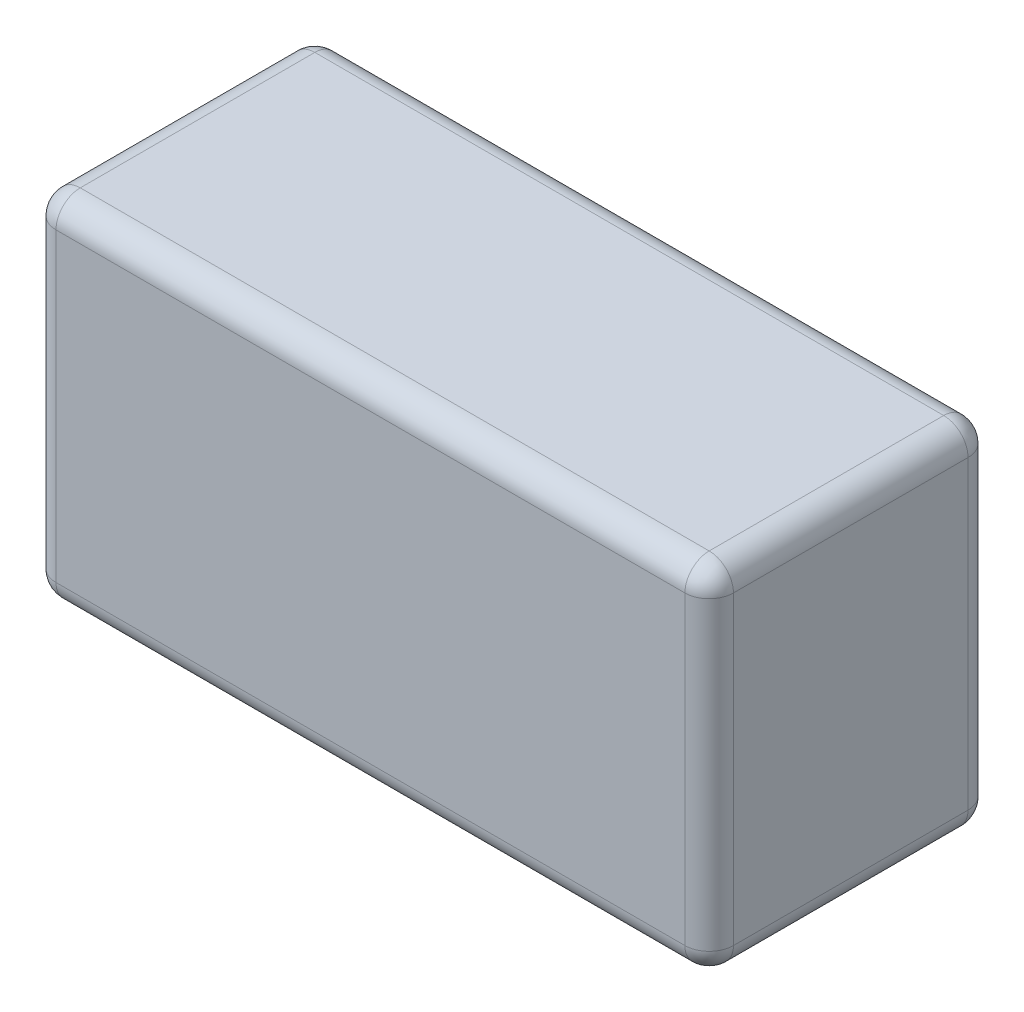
ISO-10303-21;
HEADER;
FILE_DESCRIPTION(('STEP AP214'),'2;1');
FILE_NAME('part.step','',(''),(''),'','','');
FILE_SCHEMA(('AUTOMOTIVE_DESIGN { 1 0 10303 214 1 1 1 1 }'));
ENDSEC;
DATA;
#1=APPLICATION_CONTEXT('core data for automotive mechanical design processes');
#2=APPLICATION_PROTOCOL_DEFINITION('international standard','automotive_design',2000,#1);
#3=PRODUCT_CONTEXT('',#1,'mechanical');
#4=PRODUCT('Part','Part','',(#3));
#5=PRODUCT_RELATED_PRODUCT_CATEGORY('part','',(#4));
#6=PRODUCT_DEFINITION_FORMATION('','',#4);
#7=PRODUCT_DEFINITION_CONTEXT('part definition',#1,'design');
#8=PRODUCT_DEFINITION('design','',#6,#7);
#9=PRODUCT_DEFINITION_SHAPE('','',#8);
#10=(LENGTH_UNIT() NAMED_UNIT(*) SI_UNIT(.MILLI.,.METRE.));
#11=(NAMED_UNIT(*) PLANE_ANGLE_UNIT() SI_UNIT($,.RADIAN.));
#12=(NAMED_UNIT(*) SI_UNIT($,.STERADIAN.) SOLID_ANGLE_UNIT());
#13=UNCERTAINTY_MEASURE_WITH_UNIT(LENGTH_MEASURE(1.E-05),#10,'distance_accuracy_value','');
#14=(GEOMETRIC_REPRESENTATION_CONTEXT(3) GLOBAL_UNCERTAINTY_ASSIGNED_CONTEXT((#13)) GLOBAL_UNIT_ASSIGNED_CONTEXT((#10,
#11,#12)) REPRESENTATION_CONTEXT('',''));
#15=CARTESIAN_POINT('',(0.,0.,0.));
#16=DIRECTION('',(0.,0.,1.));
#17=DIRECTION('',(1.,0.,0.));
#18=AXIS2_PLACEMENT_3D('',#15,#16,#17);
#19=CARTESIAN_POINT('',(1.555,0.755,0.12));
#20=DIRECTION('',(0.,1.,0.));
#21=DIRECTION('',(1.,0.,0.));
#22=AXIS2_PLACEMENT_3D('',#19,#20,#21);
#23=SPHERICAL_SURFACE('',#22,0.12);
#24=CARTESIAN_POINT('',(1.555,0.755,0.12));
#25=DIRECTION('',(-1.,0.,0.));
#26=DIRECTION('',(0.,0.,1.));
#27=AXIS2_PLACEMENT_3D('',#24,#25,#26);
#28=CIRCLE('',#27,0.12);
#29=CARTESIAN_POINT('',(1.555,0.875,0.12));
#30=VERTEX_POINT('',#29);
#31=CARTESIAN_POINT('',(1.555,0.755,0.));
#32=VERTEX_POINT('',#31);
#33=EDGE_CURVE('E357',#30,#32,#28,.T.);
#34=ORIENTED_EDGE('',*,*,#33,.F.);
#35=CARTESIAN_POINT('',(1.555,0.755,0.12));
#36=DIRECTION('',(0.,0.,-1.));
#37=DIRECTION('',(0.,1.,0.));
#38=AXIS2_PLACEMENT_3D('',#35,#36,#37);
#39=CIRCLE('',#38,0.12);
#40=CARTESIAN_POINT('',(1.675,0.755,0.12));
#41=VERTEX_POINT('',#40);
#42=EDGE_CURVE('E380',#41,#30,#39,.F.);
#43=ORIENTED_EDGE('',*,*,#42,.F.);
#44=CARTESIAN_POINT('',(1.555,0.755,0.12));
#45=DIRECTION('',(0.,-1.,0.));
#46=DIRECTION('',(0.,0.,-1.));
#47=AXIS2_PLACEMENT_3D('',#44,#45,#46);
#48=CIRCLE('',#47,0.12);
#49=EDGE_CURVE('E385',#32,#41,#48,.T.);
#50=ORIENTED_EDGE('',*,*,#49,.F.);
#51=EDGE_LOOP('',(#34,#43,#50));
#52=FACE_BOUND('',#51,.T.);
#53=ADVANCED_FACE('F16',(#52),#23,.T.);
#54=CARTESIAN_POINT('',(-1.555,0.755,0.12));
#55=DIRECTION('',(-1.,0.,0.));
#56=DIRECTION('',(0.,1.,0.));
#57=AXIS2_PLACEMENT_3D('',#54,#55,#56);
#58=SPHERICAL_SURFACE('',#57,0.12);
#59=CARTESIAN_POINT('',(-1.555,0.755,0.12));
#60=DIRECTION('',(0.,-1.,0.));
#61=DIRECTION('',(1.,0.,0.));
#62=AXIS2_PLACEMENT_3D('',#59,#60,#61);
#63=CIRCLE('',#62,0.12);
#64=CARTESIAN_POINT('',(-1.675,0.755,0.12));
#65=VERTEX_POINT('',#64);
#66=CARTESIAN_POINT('',(-1.555,0.75500000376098,0.));
#67=VERTEX_POINT('',#66);
#68=EDGE_CURVE('E360',#65,#67,#63,.T.);
#69=ORIENTED_EDGE('',*,*,#68,.F.);
#70=CARTESIAN_POINT('',(-1.555,0.755,0.12));
#71=DIRECTION('',(0.,0.,1.));
#72=DIRECTION('',(0.,-1.,0.));
#73=AXIS2_PLACEMENT_3D('',#70,#71,#72);
#74=CIRCLE('',#73,0.12);
#75=CARTESIAN_POINT('',(-1.555,0.875,0.119999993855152));
#76=VERTEX_POINT('',#75);
#77=EDGE_CURVE('E362',#76,#65,#74,.T.);
#78=ORIENTED_EDGE('',*,*,#77,.F.);
#79=CARTESIAN_POINT('',(-1.555,0.755,0.12));
#80=DIRECTION('',(-1.,0.,0.));
#81=DIRECTION('',(0.,0.,1.));
#82=AXIS2_PLACEMENT_3D('',#79,#80,#81);
#83=CIRCLE('',#82,0.12);
#84=EDGE_CURVE('E355',#67,#76,#83,.F.);
#85=ORIENTED_EDGE('',*,*,#84,.F.);
#86=EDGE_LOOP('',(#69,#78,#85));
#87=FACE_BOUND('',#86,.T.);
#88=ADVANCED_FACE('F282',(#87),#58,.T.);
#89=CARTESIAN_POINT('',(-1.555,-0.755,0.12));
#90=DIRECTION('',(0.,-1.,0.));
#91=DIRECTION('',(-1.,0.,0.));
#92=AXIS2_PLACEMENT_3D('',#89,#90,#91);
#93=SPHERICAL_SURFACE('',#92,0.12);
#94=CARTESIAN_POINT('',(-1.555,-0.755,0.12));
#95=DIRECTION('',(0.,0.,-1.));
#96=DIRECTION('',(-1.,0.,0.));
#97=AXIS2_PLACEMENT_3D('',#94,#95,#96);
#98=CIRCLE('',#97,0.12);
#99=CARTESIAN_POINT('',(-1.675,-0.755,0.12));
#100=VERTEX_POINT('',#99);
#101=CARTESIAN_POINT('',(-1.555,-0.875,0.119999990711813));
#102=VERTEX_POINT('',#101);
#103=EDGE_CURVE('E431',#100,#102,#98,.F.);
#104=ORIENTED_EDGE('',*,*,#103,.F.);
#105=CARTESIAN_POINT('',(-1.555,-0.755,0.12));
#106=DIRECTION('',(0.,-1.,0.));
#107=DIRECTION('',(1.,0.,0.));
#108=AXIS2_PLACEMENT_3D('',#105,#106,#107);
#109=CIRCLE('',#108,0.12);
#110=CARTESIAN_POINT('',(-1.555,-0.755000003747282,0.));
#111=VERTEX_POINT('',#110);
#112=EDGE_CURVE('E367',#111,#100,#109,.F.);
#113=ORIENTED_EDGE('',*,*,#112,.F.);
#114=CARTESIAN_POINT('',(-1.555,-0.755,0.12));
#115=DIRECTION('',(1.,0.,0.));
#116=DIRECTION('',(0.,0.,-1.));
#117=AXIS2_PLACEMENT_3D('',#114,#115,#116);
#118=CIRCLE('',#117,0.12);
#119=EDGE_CURVE('E443',#102,#111,#118,.T.);
#120=ORIENTED_EDGE('',*,*,#119,.F.);
#121=EDGE_LOOP('',(#104,#113,#120));
#122=FACE_BOUND('',#121,.T.);
#123=ADVANCED_FACE('F269',(#122),#93,.T.);
#124=CARTESIAN_POINT('',(1.555,-0.755,0.12));
#125=DIRECTION('',(1.,0.,0.));
#126=DIRECTION('',(0.,-1.,0.));
#127=AXIS2_PLACEMENT_3D('',#124,#125,#126);
#128=SPHERICAL_SURFACE('',#127,0.12);
#129=CARTESIAN_POINT('',(1.555,-0.755,0.12));
#130=DIRECTION('',(1.,0.,0.));
#131=DIRECTION('',(0.,0.,-1.));
#132=AXIS2_PLACEMENT_3D('',#129,#130,#131);
#133=CIRCLE('',#132,0.12);
#134=CARTESIAN_POINT('',(1.555,-0.755,0.));
#135=VERTEX_POINT('',#134);
#136=CARTESIAN_POINT('',(1.555,-0.875,0.12));
#137=VERTEX_POINT('',#136);
#138=EDGE_CURVE('E450',#135,#137,#133,.F.);
#139=ORIENTED_EDGE('',*,*,#138,.F.);
#140=CARTESIAN_POINT('',(1.555,-0.755,0.12));
#141=DIRECTION('',(0.,-1.,0.));
#142=DIRECTION('',(0.,0.,-1.));
#143=AXIS2_PLACEMENT_3D('',#140,#141,#142);
#144=CIRCLE('',#143,0.12);
#145=CARTESIAN_POINT('',(1.675,-0.755,0.12));
#146=VERTEX_POINT('',#145);
#147=EDGE_CURVE('E395',#146,#135,#144,.F.);
#148=ORIENTED_EDGE('',*,*,#147,.F.);
#149=CARTESIAN_POINT('',(1.555,-0.755,0.12));
#150=DIRECTION('',(0.,0.,1.));
#151=DIRECTION('',(1.,0.,0.));
#152=AXIS2_PLACEMENT_3D('',#149,#150,#151);
#153=CIRCLE('',#152,0.12);
#154=EDGE_CURVE('E392',#137,#146,#153,.T.);
#155=ORIENTED_EDGE('',*,*,#154,.F.);
#156=EDGE_LOOP('',(#139,#148,#155));
#157=FACE_BOUND('',#156,.T.);
#158=ADVANCED_FACE('F264',(#157),#128,.T.);
#159=CARTESIAN_POINT('',(1.555,-1.235,0.12));
#160=DIRECTION('',(0.,-1.,0.));
#161=DIRECTION('',(0.,0.,-1.));
#162=AXIS2_PLACEMENT_3D('',#159,#160,#161);
#163=CYLINDRICAL_SURFACE('',#162,0.12);
#164=DIRECTION('',(0.,-1.,0.));
#165=VECTOR('',#164,1.);
#166=CARTESIAN_POINT('',(1.555,-1.235,0.));
#167=LINE('',#166,#165);
#168=EDGE_CURVE('E398',#135,#32,#167,.F.);
#169=ORIENTED_EDGE('',*,*,#168,.T.);
#170=ORIENTED_EDGE('',*,*,#49,.T.);
#171=DIRECTION('',(0.,1.,0.));
#172=VECTOR('',#171,1.);
#173=CARTESIAN_POINT('',(1.675,-0.875,0.12));
#174=LINE('',#173,#172);
#175=EDGE_CURVE('E388',#146,#41,#174,.T.);
#176=ORIENTED_EDGE('',*,*,#175,.F.);
#177=ORIENTED_EDGE('',*,*,#147,.T.);
#178=EDGE_LOOP('',(#169,#170,#176,#177));
#179=FACE_BOUND('',#178,.T.);
#180=ADVANCED_FACE('F260',(#179),#163,.T.);
#181=CARTESIAN_POINT('',(1.555,0.755,1.88));
#182=DIRECTION('',(0.,0.,-1.));
#183=DIRECTION('',(0.,1.,0.));
#184=AXIS2_PLACEMENT_3D('',#181,#182,#183);
#185=CYLINDRICAL_SURFACE('',#184,0.12);
#186=CARTESIAN_POINT('',(1.555,0.755,1.28));
#187=DIRECTION('',(0.,0.,1.));
#188=DIRECTION('',(1.,0.,0.));
#189=AXIS2_PLACEMENT_3D('',#186,#187,#188);
#190=CIRCLE('',#189,0.12);
#191=CARTESIAN_POINT('',(1.675,0.755,1.28));
#192=VERTEX_POINT('',#191);
#193=CARTESIAN_POINT('',(1.555,0.875,1.28));
#194=VERTEX_POINT('',#193);
#195=EDGE_CURVE('E130',#192,#194,#190,.T.);
#196=ORIENTED_EDGE('',*,*,#195,.F.);
#197=DIRECTION('',(0.,0.,-1.));
#198=VECTOR('',#197,1.);
#199=CARTESIAN_POINT('',(1.675,0.755,1.4));
#200=LINE('',#199,#198);
#201=EDGE_CURVE('E391',#41,#192,#200,.F.);
#202=ORIENTED_EDGE('',*,*,#201,.F.);
#203=ORIENTED_EDGE('',*,*,#42,.T.);
#204=DIRECTION('',(0.,0.,1.));
#205=VECTOR('',#204,1.);
#206=CARTESIAN_POINT('',(1.555,0.875,0.));
#207=LINE('',#206,#205);
#208=EDGE_CURVE('E221',#194,#30,#207,.F.);
#209=ORIENTED_EDGE('',*,*,#208,.F.);
#210=EDGE_LOOP('',(#196,#202,#203,#209));
#211=FACE_BOUND('',#210,.T.);
#212=ADVANCED_FACE('F256',(#211),#185,.T.);
#213=CARTESIAN_POINT('',(-1.555,-1.235,0.12));
#214=DIRECTION('',(0.,-1.,0.));
#215=DIRECTION('',(1.,0.,0.));
#216=AXIS2_PLACEMENT_3D('',#213,#214,#215);
#217=CYLINDRICAL_SURFACE('',#216,0.12);
#218=DIRECTION('',(0.,1.,0.));
#219=VECTOR('',#218,1.);
#220=CARTESIAN_POINT('',(-1.675,-0.875,0.12));
#221=LINE('',#220,#219);
#222=EDGE_CURVE('E213',#65,#100,#221,.F.);
#223=ORIENTED_EDGE('',*,*,#222,.F.);
#224=ORIENTED_EDGE('',*,*,#68,.T.);
#225=DIRECTION('',(0.,-1.,0.));
#226=VECTOR('',#225,1.);
#227=CARTESIAN_POINT('',(-1.555,-1.235,0.));
#228=LINE('',#227,#226);
#229=EDGE_CURVE('E280',#67,#111,#228,.T.);
#230=ORIENTED_EDGE('',*,*,#229,.T.);
#231=ORIENTED_EDGE('',*,*,#112,.T.);
#232=EDGE_LOOP('',(#223,#224,#230,#231));
#233=FACE_BOUND('',#232,.T.);
#234=ADVANCED_FACE('F252',(#233),#217,.T.);
#235=CARTESIAN_POINT('',(-1.555,0.755,-0.48));
#236=DIRECTION('',(0.,0.,1.));
#237=DIRECTION('',(0.,-1.,0.));
#238=AXIS2_PLACEMENT_3D('',#235,#236,#237);
#239=CYLINDRICAL_SURFACE('',#238,0.12);
#240=CARTESIAN_POINT('',(-1.555,0.755,1.28));
#241=DIRECTION('',(0.,0.,1.));
#242=DIRECTION('',(0.,1.,0.));
#243=AXIS2_PLACEMENT_3D('',#240,#241,#242);
#244=CIRCLE('',#243,0.12);
#245=CARTESIAN_POINT('',(-1.555,0.875,1.28000000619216));
#246=VERTEX_POINT('',#245);
#247=CARTESIAN_POINT('',(-1.675,0.755,1.28));
#248=VERTEX_POINT('',#247);
#249=EDGE_CURVE('E191',#246,#248,#244,.T.);
#250=ORIENTED_EDGE('',*,*,#249,.F.);
#251=DIRECTION('',(0.,0.,1.));
#252=VECTOR('',#251,1.);
#253=CARTESIAN_POINT('',(-1.555,0.875,0.));
#254=LINE('',#253,#252);
#255=EDGE_CURVE('E216',#76,#246,#254,.T.);
#256=ORIENTED_EDGE('',*,*,#255,.F.);
#257=ORIENTED_EDGE('',*,*,#77,.T.);
#258=DIRECTION('',(0.,0.,1.));
#259=VECTOR('',#258,1.);
#260=CARTESIAN_POINT('',(-1.675,0.755,0.));
#261=LINE('',#260,#259);
#262=EDGE_CURVE('E197',#248,#65,#261,.F.);
#263=ORIENTED_EDGE('',*,*,#262,.F.);
#264=EDGE_LOOP('',(#250,#256,#257,#263));
#265=FACE_BOUND('',#264,.T.);
#266=ADVANCED_FACE('F249',(#265),#239,.T.);
#267=CARTESIAN_POINT('',(1.675,-0.875,0.));
#268=DIRECTION('',(0.,0.,-1.));
#269=DIRECTION('',(-1.,0.,0.));
#270=AXIS2_PLACEMENT_3D('',#267,#268,#269);
#271=PLANE('',#270);
#272=ORIENTED_EDGE('',*,*,#168,.F.);
#273=DIRECTION('',(-1.,0.,0.));
#274=VECTOR('',#273,1.);
#275=CARTESIAN_POINT('',(1.675,-0.755000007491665,0.));
#276=LINE('',#275,#274);
#277=EDGE_CURVE('E51',#111,#135,#276,.F.);
#278=ORIENTED_EDGE('',*,*,#277,.F.);
#279=ORIENTED_EDGE('',*,*,#229,.F.);
#280=DIRECTION('',(-1.,0.,0.));
#281=VECTOR('',#280,1.);
#282=CARTESIAN_POINT('',(2.035,0.755000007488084,0.));
#283=LINE('',#282,#281);
#284=EDGE_CURVE('E59',#32,#67,#283,.T.);
#285=ORIENTED_EDGE('',*,*,#284,.F.);
#286=EDGE_LOOP('',(#272,#278,#279,#285));
#287=FACE_BOUND('',#286,.T.);
#288=ADVANCED_FACE('F245',(#287),#271,.T.);
#289=CARTESIAN_POINT('',(-1.555,-0.755,-0.48));
#290=DIRECTION('',(0.,0.,-1.));
#291=DIRECTION('',(-1.,0.,0.));
#292=AXIS2_PLACEMENT_3D('',#289,#290,#291);
#293=CYLINDRICAL_SURFACE('',#292,0.12);
#294=CARTESIAN_POINT('',(-1.555,-0.755,1.28));
#295=DIRECTION('',(0.,0.,1.));
#296=DIRECTION('',(-1.,0.,0.));
#297=AXIS2_PLACEMENT_3D('',#294,#295,#296);
#298=CIRCLE('',#297,0.12);
#299=CARTESIAN_POINT('',(-1.675,-0.755,1.28));
#300=VERTEX_POINT('',#299);
#301=CARTESIAN_POINT('',(-1.555,-0.875,1.28));
#302=VERTEX_POINT('',#301);
#303=EDGE_CURVE('E188',#300,#302,#298,.T.);
#304=ORIENTED_EDGE('',*,*,#303,.F.);
#305=DIRECTION('',(0.,0.,1.));
#306=VECTOR('',#305,1.);
#307=CARTESIAN_POINT('',(-1.675,-0.755,0.));
#308=LINE('',#307,#306);
#309=EDGE_CURVE('E208',#100,#300,#308,.T.);
#310=ORIENTED_EDGE('',*,*,#309,.F.);
#311=ORIENTED_EDGE('',*,*,#103,.T.);
#312=DIRECTION('',(0.,0.,1.));
#313=VECTOR('',#312,1.);
#314=CARTESIAN_POINT('',(-1.555,-0.875,0.));
#315=LINE('',#314,#313);
#316=EDGE_CURVE('E408',#102,#302,#315,.T.);
#317=ORIENTED_EDGE('',*,*,#316,.T.);
#318=EDGE_LOOP('',(#304,#310,#311,#317));
#319=FACE_BOUND('',#318,.T.);
#320=ADVANCED_FACE('F241',(#319),#293,.T.);
#321=CARTESIAN_POINT('',(1.555,-0.755,1.88));
#322=DIRECTION('',(0.,0.,1.));
#323=DIRECTION('',(1.,0.,0.));
#324=AXIS2_PLACEMENT_3D('',#321,#322,#323);
#325=CYLINDRICAL_SURFACE('',#324,0.12);
#326=CARTESIAN_POINT('',(1.555,-0.755,1.28));
#327=DIRECTION('',(0.,0.,1.));
#328=DIRECTION('',(0.,-1.,0.));
#329=AXIS2_PLACEMENT_3D('',#326,#327,#328);
#330=CIRCLE('',#329,0.12);
#331=CARTESIAN_POINT('',(1.555,-0.875,1.28000000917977));
#332=VERTEX_POINT('',#331);
#333=CARTESIAN_POINT('',(1.675,-0.755,1.28));
#334=VERTEX_POINT('',#333);
#335=EDGE_CURVE('E159',#332,#334,#330,.T.);
#336=ORIENTED_EDGE('',*,*,#335,.F.);
#337=DIRECTION('',(0.,0.,1.));
#338=VECTOR('',#337,1.);
#339=CARTESIAN_POINT('',(1.555,-0.875,0.));
#340=LINE('',#339,#338);
#341=EDGE_CURVE('E422',#332,#137,#340,.F.);
#342=ORIENTED_EDGE('',*,*,#341,.T.);
#343=ORIENTED_EDGE('',*,*,#154,.T.);
#344=DIRECTION('',(0.,0.,-1.));
#345=VECTOR('',#344,1.);
#346=CARTESIAN_POINT('',(1.675,-0.755,1.4));
#347=LINE('',#346,#345);
#348=EDGE_CURVE('E424',#334,#146,#347,.T.);
#349=ORIENTED_EDGE('',*,*,#348,.F.);
#350=EDGE_LOOP('',(#336,#342,#343,#349));
#351=FACE_BOUND('',#350,.T.);
#352=ADVANCED_FACE('F237',(#351),#325,.T.);
#353=CARTESIAN_POINT('',(1.675,-0.875,1.4));
#354=DIRECTION('',(1.,0.,0.));
#355=DIRECTION('',(0.,0.,-1.));
#356=AXIS2_PLACEMENT_3D('',#353,#354,#355);
#357=PLANE('',#356);
#358=DIRECTION('',(0.,-1.,0.));
#359=VECTOR('',#358,1.);
#360=CARTESIAN_POINT('',(1.675,-1.235,1.28));
#361=LINE('',#360,#359);
#362=EDGE_CURVE('E139',#334,#192,#361,.F.);
#363=ORIENTED_EDGE('',*,*,#362,.F.);
#364=ORIENTED_EDGE('',*,*,#348,.T.);
#365=ORIENTED_EDGE('',*,*,#175,.T.);
#366=ORIENTED_EDGE('',*,*,#201,.T.);
#367=EDGE_LOOP('',(#363,#364,#365,#366));
#368=FACE_BOUND('',#367,.T.);
#369=ADVANCED_FACE('F234',(#368),#357,.T.);
#370=CARTESIAN_POINT('',(1.555,0.755,1.28));
#371=DIRECTION('',(1.,0.,0.));
#372=DIRECTION('',(0.,1.,0.));
#373=AXIS2_PLACEMENT_3D('',#370,#371,#372);
#374=SPHERICAL_SURFACE('',#373,0.12);
#375=CARTESIAN_POINT('',(1.555,0.755,1.28));
#376=DIRECTION('',(1.,0.,0.));
#377=DIRECTION('',(0.,0.,-1.));
#378=AXIS2_PLACEMENT_3D('',#375,#376,#377);
#379=CIRCLE('',#378,0.12);
#380=CARTESIAN_POINT('',(1.555,0.755,1.4));
#381=VERTEX_POINT('',#380);
#382=EDGE_CURVE('E113',#381,#194,#379,.F.);
#383=ORIENTED_EDGE('',*,*,#382,.F.);
#384=CARTESIAN_POINT('',(1.555,0.755,1.28));
#385=DIRECTION('',(0.,-1.,0.));
#386=DIRECTION('',(1.,0.,0.));
#387=AXIS2_PLACEMENT_3D('',#384,#385,#386);
#388=CIRCLE('',#387,0.12);
#389=EDGE_CURVE('E128',#192,#381,#388,.T.);
#390=ORIENTED_EDGE('',*,*,#389,.F.);
#391=ORIENTED_EDGE('',*,*,#195,.T.);
#392=EDGE_LOOP('',(#383,#390,#391));
#393=FACE_BOUND('',#392,.T.);
#394=ADVANCED_FACE('F127',(#393),#374,.T.);
#395=CARTESIAN_POINT('',(2.035,0.755,0.12));
#396=DIRECTION('',(-1.,0.,0.));
#397=DIRECTION('',(0.,0.,1.));
#398=AXIS2_PLACEMENT_3D('',#395,#396,#397);
#399=CYLINDRICAL_SURFACE('',#398,0.12);
#400=ORIENTED_EDGE('',*,*,#284,.T.);
#401=ORIENTED_EDGE('',*,*,#84,.T.);
#402=DIRECTION('',(1.,0.,0.));
#403=VECTOR('',#402,1.);
#404=CARTESIAN_POINT('',(0.,0.875,0.11999998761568));
#405=LINE('',#404,#403);
#406=EDGE_CURVE('E131',#30,#76,#405,.F.);
#407=ORIENTED_EDGE('',*,*,#406,.F.);
#408=ORIENTED_EDGE('',*,*,#33,.T.);
#409=EDGE_LOOP('',(#400,#401,#407,#408));
#410=FACE_BOUND('',#409,.T.);
#411=ADVANCED_FACE('F233',(#410),#399,.T.);
#412=CARTESIAN_POINT('',(-1.675,-0.875,0.));
#413=DIRECTION('',(-1.,0.,0.));
#414=DIRECTION('',(0.,0.,1.));
#415=AXIS2_PLACEMENT_3D('',#412,#413,#414);
#416=PLANE('',#415);
#417=DIRECTION('',(0.,-1.,0.));
#418=VECTOR('',#417,1.);
#419=CARTESIAN_POINT('',(-1.675,-1.235,1.28));
#420=LINE('',#419,#418);
#421=EDGE_CURVE('E200',#248,#300,#420,.T.);
#422=ORIENTED_EDGE('',*,*,#421,.F.);
#423=ORIENTED_EDGE('',*,*,#262,.T.);
#424=ORIENTED_EDGE('',*,*,#222,.T.);
#425=ORIENTED_EDGE('',*,*,#309,.T.);
#426=EDGE_LOOP('',(#422,#423,#424,#425));
#427=FACE_BOUND('',#426,.T.);
#428=ADVANCED_FACE('F435',(#427),#416,.T.);
#429=CARTESIAN_POINT('',(-1.555,0.755,1.28));
#430=DIRECTION('',(0.,1.,0.));
#431=DIRECTION('',(-1.,0.,0.));
#432=AXIS2_PLACEMENT_3D('',#429,#430,#431);
#433=SPHERICAL_SURFACE('',#432,0.12);
#434=CARTESIAN_POINT('',(-1.555,0.755,1.28));
#435=DIRECTION('',(0.,-1.,0.));
#436=DIRECTION('',(0.,0.,-1.));
#437=AXIS2_PLACEMENT_3D('',#434,#435,#436);
#438=CIRCLE('',#437,0.12);
#439=CARTESIAN_POINT('',(-1.555,0.755000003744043,1.4));
#440=VERTEX_POINT('',#439);
#441=EDGE_CURVE('E322',#440,#248,#438,.T.);
#442=ORIENTED_EDGE('',*,*,#441,.F.);
#443=CARTESIAN_POINT('',(-1.555,0.755,1.28));
#444=DIRECTION('',(1.,0.,0.));
#445=DIRECTION('',(0.,0.,-1.));
#446=AXIS2_PLACEMENT_3D('',#443,#444,#445);
#447=CIRCLE('',#446,0.12);
#448=EDGE_CURVE('E115',#246,#440,#447,.T.);
#449=ORIENTED_EDGE('',*,*,#448,.F.);
#450=ORIENTED_EDGE('',*,*,#249,.T.);
#451=EDGE_LOOP('',(#442,#449,#450));
#452=FACE_BOUND('',#451,.T.);
#453=ADVANCED_FACE('F179',(#452),#433,.T.);
#454=CARTESIAN_POINT('',(-1.555,-0.755,1.28));
#455=DIRECTION('',(-1.,0.,0.));
#456=DIRECTION('',(0.,-1.,0.));
#457=AXIS2_PLACEMENT_3D('',#454,#455,#456);
#458=SPHERICAL_SURFACE('',#457,0.12);
#459=ORIENTED_EDGE('',*,*,#303,.T.);
#460=CARTESIAN_POINT('',(-1.555,-0.755,1.28));
#461=DIRECTION('',(-1.,0.,0.));
#462=DIRECTION('',(0.,0.,1.));
#463=AXIS2_PLACEMENT_3D('',#460,#461,#462);
#464=CIRCLE('',#463,0.12);
#465=CARTESIAN_POINT('',(-1.555,-0.755,1.4));
#466=VERTEX_POINT('',#465);
#467=EDGE_CURVE('E331',#466,#302,#464,.F.);
#468=ORIENTED_EDGE('',*,*,#467,.F.);
#469=CARTESIAN_POINT('',(-1.555,-0.755,1.28));
#470=DIRECTION('',(0.,-1.,0.));
#471=DIRECTION('',(0.,0.,-1.));
#472=AXIS2_PLACEMENT_3D('',#469,#470,#471);
#473=CIRCLE('',#472,0.12);
#474=EDGE_CURVE('E203',#300,#466,#473,.F.);
#475=ORIENTED_EDGE('',*,*,#474,.F.);
#476=EDGE_LOOP('',(#459,#468,#475));
#477=FACE_BOUND('',#476,.T.);
#478=ADVANCED_FACE('F175',(#477),#458,.T.);
#479=CARTESIAN_POINT('',(2.035,-0.755,0.12));
#480=DIRECTION('',(1.,0.,0.));
#481=DIRECTION('',(0.,0.,-1.));
#482=AXIS2_PLACEMENT_3D('',#479,#480,#481);
#483=CYLINDRICAL_SURFACE('',#482,0.12);
#484=ORIENTED_EDGE('',*,*,#277,.T.);
#485=ORIENTED_EDGE('',*,*,#138,.T.);
#486=DIRECTION('',(1.,0.,0.));
#487=VECTOR('',#486,1.);
#488=CARTESIAN_POINT('',(0.,-0.875,0.119999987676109));
#489=LINE('',#488,#487);
#490=EDGE_CURVE('E148',#137,#102,#489,.F.);
#491=ORIENTED_EDGE('',*,*,#490,.T.);
#492=ORIENTED_EDGE('',*,*,#119,.T.);
#493=EDGE_LOOP('',(#484,#485,#491,#492));
#494=FACE_BOUND('',#493,.T.);
#495=ADVANCED_FACE('F170',(#494),#483,.T.);
#496=CARTESIAN_POINT('',(1.555,-0.755,1.28));
#497=DIRECTION('',(0.,-1.,0.));
#498=DIRECTION('',(1.,0.,0.));
#499=AXIS2_PLACEMENT_3D('',#496,#497,#498);
#500=SPHERICAL_SURFACE('',#499,0.12);
#501=CARTESIAN_POINT('',(1.555,-0.755,1.28));
#502=DIRECTION('',(-1.,0.,0.));
#503=DIRECTION('',(0.,0.,1.));
#504=AXIS2_PLACEMENT_3D('',#501,#502,#503);
#505=CIRCLE('',#504,0.12);
#506=CARTESIAN_POINT('',(1.555,-0.755000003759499,1.4));
#507=VERTEX_POINT('',#506);
#508=EDGE_CURVE('E144',#332,#507,#505,.T.);
#509=ORIENTED_EDGE('',*,*,#508,.F.);
#510=ORIENTED_EDGE('',*,*,#335,.T.);
#511=CARTESIAN_POINT('',(1.555,-0.755,1.28));
#512=DIRECTION('',(0.,-1.,0.));
#513=DIRECTION('',(1.,0.,0.));
#514=AXIS2_PLACEMENT_3D('',#511,#512,#513);
#515=CIRCLE('',#514,0.12);
#516=EDGE_CURVE('E157',#507,#334,#515,.F.);
#517=ORIENTED_EDGE('',*,*,#516,.F.);
#518=EDGE_LOOP('',(#509,#510,#517));
#519=FACE_BOUND('',#518,.T.);
#520=ADVANCED_FACE('F166',(#519),#500,.T.);
#521=CARTESIAN_POINT('',(1.555,-1.235,1.28));
#522=DIRECTION('',(0.,-1.,0.));
#523=DIRECTION('',(1.,0.,0.));
#524=AXIS2_PLACEMENT_3D('',#521,#522,#523);
#525=CYLINDRICAL_SURFACE('',#524,0.12);
#526=ORIENTED_EDGE('',*,*,#362,.T.);
#527=ORIENTED_EDGE('',*,*,#389,.T.);
#528=DIRECTION('',(0.,1.,0.));
#529=VECTOR('',#528,1.);
#530=CARTESIAN_POINT('',(1.555,-0.875,1.4));
#531=LINE('',#530,#529);
#532=EDGE_CURVE('E137',#507,#381,#531,.T.);
#533=ORIENTED_EDGE('',*,*,#532,.F.);
#534=ORIENTED_EDGE('',*,*,#516,.T.);
#535=EDGE_LOOP('',(#526,#527,#533,#534));
#536=FACE_BOUND('',#535,.T.);
#537=ADVANCED_FACE('F135',(#536),#525,.T.);
#538=CARTESIAN_POINT('',(0.,0.875,0.));
#539=DIRECTION('',(0.,1.,0.));
#540=DIRECTION('',(0.,0.,1.));
#541=AXIS2_PLACEMENT_3D('',#538,#539,#540);
#542=PLANE('',#541);
#543=ORIENTED_EDGE('',*,*,#255,.T.);
#544=DIRECTION('',(1.,0.,0.));
#545=VECTOR('',#544,1.);
#546=CARTESIAN_POINT('',(-2.035,0.874999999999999,1.2800000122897));
#547=LINE('',#546,#545);
#548=EDGE_CURVE('E143',#194,#246,#547,.F.);
#549=ORIENTED_EDGE('',*,*,#548,.F.);
#550=ORIENTED_EDGE('',*,*,#208,.T.);
#551=ORIENTED_EDGE('',*,*,#406,.T.);
#552=EDGE_LOOP('',(#543,#549,#550,#551));
#553=FACE_BOUND('',#552,.T.);
#554=ADVANCED_FACE('F308',(#553),#542,.T.);
#555=CARTESIAN_POINT('',(-1.555,-1.235,1.28));
#556=DIRECTION('',(0.,-1.,0.));
#557=DIRECTION('',(0.,0.,-1.));
#558=AXIS2_PLACEMENT_3D('',#555,#556,#557);
#559=CYLINDRICAL_SURFACE('',#558,0.12);
#560=DIRECTION('',(0.,1.,0.));
#561=VECTOR('',#560,1.);
#562=CARTESIAN_POINT('',(-1.555,-0.875,1.4));
#563=LINE('',#562,#561);
#564=EDGE_CURVE('E146',#440,#466,#563,.F.);
#565=ORIENTED_EDGE('',*,*,#564,.F.);
#566=ORIENTED_EDGE('',*,*,#441,.T.);
#567=ORIENTED_EDGE('',*,*,#421,.T.);
#568=ORIENTED_EDGE('',*,*,#474,.T.);
#569=EDGE_LOOP('',(#565,#566,#567,#568));
#570=FACE_BOUND('',#569,.T.);
#571=ADVANCED_FACE('F305',(#570),#559,.T.);
#572=CARTESIAN_POINT('',(0.,-0.875,0.));
#573=DIRECTION('',(0.,1.,0.));
#574=DIRECTION('',(0.,0.,1.));
#575=AXIS2_PLACEMENT_3D('',#572,#573,#574);
#576=PLANE('',#575);
#577=ORIENTED_EDGE('',*,*,#316,.F.);
#578=ORIENTED_EDGE('',*,*,#490,.F.);
#579=ORIENTED_EDGE('',*,*,#341,.F.);
#580=DIRECTION('',(-1.,0.,0.));
#581=VECTOR('',#580,1.);
#582=CARTESIAN_POINT('',(-2.035,-0.874999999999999,1.28000001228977));
#583=LINE('',#582,#581);
#584=EDGE_CURVE('E121',#302,#332,#583,.F.);
#585=ORIENTED_EDGE('',*,*,#584,.F.);
#586=EDGE_LOOP('',(#577,#578,#579,#585));
#587=FACE_BOUND('',#586,.T.);
#588=ADVANCED_FACE('F302',(#587),#576,.F.);
#589=CARTESIAN_POINT('',(-2.035,0.755,1.28));
#590=DIRECTION('',(1.,0.,0.));
#591=DIRECTION('',(0.,0.,-1.));
#592=AXIS2_PLACEMENT_3D('',#589,#590,#591);
#593=CYLINDRICAL_SURFACE('',#592,0.12);
#594=DIRECTION('',(1.,0.,0.));
#595=VECTOR('',#594,1.);
#596=CARTESIAN_POINT('',(-1.675,0.755000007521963,1.4));
#597=LINE('',#596,#595);
#598=EDGE_CURVE('E26',#381,#440,#597,.F.);
#599=ORIENTED_EDGE('',*,*,#598,.F.);
#600=ORIENTED_EDGE('',*,*,#382,.T.);
#601=ORIENTED_EDGE('',*,*,#548,.T.);
#602=ORIENTED_EDGE('',*,*,#448,.T.);
#603=EDGE_LOOP('',(#599,#600,#601,#602));
#604=FACE_BOUND('',#603,.T.);
#605=ADVANCED_FACE('F112',(#604),#593,.T.);
#606=CARTESIAN_POINT('',(-2.035,-0.755,1.28));
#607=DIRECTION('',(-1.,0.,0.));
#608=DIRECTION('',(0.,0.,1.));
#609=AXIS2_PLACEMENT_3D('',#606,#607,#608);
#610=CYLINDRICAL_SURFACE('',#609,0.12);
#611=ORIENTED_EDGE('',*,*,#584,.T.);
#612=ORIENTED_EDGE('',*,*,#508,.T.);
#613=DIRECTION('',(1.,0.,0.));
#614=VECTOR('',#613,1.);
#615=CARTESIAN_POINT('',(-1.675,-0.755000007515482,1.4));
#616=LINE('',#615,#614);
#617=EDGE_CURVE('E11',#466,#507,#616,.T.);
#618=ORIENTED_EDGE('',*,*,#617,.F.);
#619=ORIENTED_EDGE('',*,*,#467,.T.);
#620=EDGE_LOOP('',(#611,#612,#618,#619));
#621=FACE_BOUND('',#620,.T.);
#622=ADVANCED_FACE('F293',(#621),#610,.T.);
#623=CARTESIAN_POINT('',(-1.675,-0.875,1.4));
#624=DIRECTION('',(0.,0.,1.));
#625=DIRECTION('',(1.,0.,0.));
#626=AXIS2_PLACEMENT_3D('',#623,#624,#625);
#627=PLANE('',#626);
#628=ORIENTED_EDGE('',*,*,#564,.T.);
#629=ORIENTED_EDGE('',*,*,#617,.T.);
#630=ORIENTED_EDGE('',*,*,#532,.T.);
#631=ORIENTED_EDGE('',*,*,#598,.T.);
#632=EDGE_LOOP('',(#628,#629,#630,#631));
#633=FACE_BOUND('',#632,.T.);
#634=ADVANCED_FACE('F141',(#633),#627,.T.);
#635=CLOSED_SHELL('',(#53,#88,#123,#158,#180,#212,#234,#266,#288,#320,#352,#369,#394,#411,#428,
#453,#478,#495,#520,#537,#554,#571,#588,#605,#622,#634));
#636=MANIFOLD_SOLID_BREP('B1',#635);
#637=ADVANCED_BREP_SHAPE_REPRESENTATION('',(#18,#636),#14);
#638=SHAPE_DEFINITION_REPRESENTATION(#9,#637);
ENDSEC;
END-ISO-10303-21;
